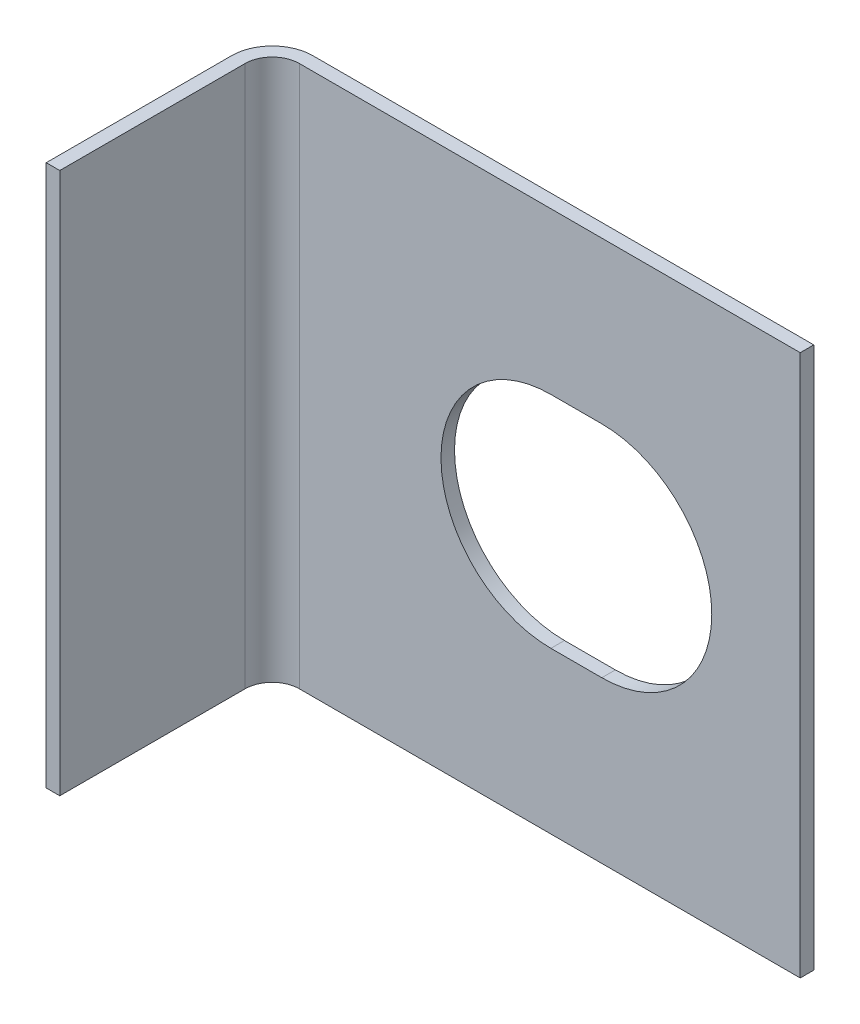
ISO-10303-21;
HEADER;
FILE_DESCRIPTION(('STEP AP214'),'2;1');
FILE_NAME('part.step','',(''),(''),'','','');
FILE_SCHEMA(('AUTOMOTIVE_DESIGN { 1 0 10303 214 1 1 1 1 }'));
ENDSEC;
DATA;
#1=APPLICATION_CONTEXT('core data for automotive mechanical design processes');
#2=APPLICATION_PROTOCOL_DEFINITION('international standard','automotive_design',2000,#1);
#3=PRODUCT_CONTEXT('',#1,'mechanical');
#4=PRODUCT('Part','Part','',(#3));
#5=PRODUCT_RELATED_PRODUCT_CATEGORY('part','',(#4));
#6=PRODUCT_DEFINITION_FORMATION('','',#4);
#7=PRODUCT_DEFINITION_CONTEXT('part definition',#1,'design');
#8=PRODUCT_DEFINITION('design','',#6,#7);
#9=PRODUCT_DEFINITION_SHAPE('','',#8);
#10=(LENGTH_UNIT() NAMED_UNIT(*) SI_UNIT(.MILLI.,.METRE.));
#11=(NAMED_UNIT(*) PLANE_ANGLE_UNIT() SI_UNIT($,.RADIAN.));
#12=(NAMED_UNIT(*) SI_UNIT($,.STERADIAN.) SOLID_ANGLE_UNIT());
#13=UNCERTAINTY_MEASURE_WITH_UNIT(LENGTH_MEASURE(1.E-05),#10,'distance_accuracy_value','');
#14=(GEOMETRIC_REPRESENTATION_CONTEXT(3) GLOBAL_UNCERTAINTY_ASSIGNED_CONTEXT((#13)) GLOBAL_UNIT_ASSIGNED_CONTEXT((#10,
#11,#12)) REPRESENTATION_CONTEXT('',''));
#15=CARTESIAN_POINT('',(0.,0.,0.));
#16=DIRECTION('',(0.,0.,1.));
#17=DIRECTION('',(1.,0.,0.));
#18=AXIS2_PLACEMENT_3D('',#15,#16,#17);
#19=CARTESIAN_POINT('',(-12.995,12.7,1.905));
#20=DIRECTION('',(0.,-1.,0.));
#21=DIRECTION('',(0.,0.,-1.));
#22=AXIS2_PLACEMENT_3D('',#19,#20,#21);
#23=CYLINDRICAL_SURFACE('',#22,1.905);
#24=CARTESIAN_POINT('',(-12.995,-12.7,1.905));
#25=DIRECTION('',(0.,1.,0.));
#26=DIRECTION('',(0.,0.,-1.));
#27=AXIS2_PLACEMENT_3D('',#24,#25,#26);
#28=CIRCLE('',#27,1.905);
#29=CARTESIAN_POINT('',(-12.995,-12.7,0.));
#30=VERTEX_POINT('',#29);
#31=CARTESIAN_POINT('',(-14.9,-12.7,1.905));
#32=VERTEX_POINT('',#31);
#33=EDGE_CURVE('E135',#30,#32,#28,.T.);
#34=ORIENTED_EDGE('',*,*,#33,.T.);
#35=DIRECTION('',(0.,-1.,0.));
#36=VECTOR('',#35,1.);
#37=CARTESIAN_POINT('',(-14.9,12.7,1.905));
#38=LINE('',#37,#36);
#39=CARTESIAN_POINT('',(-14.9,12.7,1.905));
#40=VERTEX_POINT('',#39);
#41=EDGE_CURVE('E9',#40,#32,#38,.T.);
#42=ORIENTED_EDGE('',*,*,#41,.F.);
#43=CARTESIAN_POINT('',(-12.995,12.7,1.905));
#44=DIRECTION('',(0.,1.,0.));
#45=DIRECTION('',(0.,0.,-1.));
#46=AXIS2_PLACEMENT_3D('',#43,#44,#45);
#47=CIRCLE('',#46,1.905);
#48=CARTESIAN_POINT('',(-12.995,12.7,0.));
#49=VERTEX_POINT('',#48);
#50=EDGE_CURVE('E139',#49,#40,#47,.T.);
#51=ORIENTED_EDGE('',*,*,#50,.F.);
#52=DIRECTION('',(0.,-1.,0.));
#53=VECTOR('',#52,1.);
#54=CARTESIAN_POINT('',(-12.995,12.7,0.));
#55=LINE('',#54,#53);
#56=EDGE_CURVE('E157',#49,#30,#55,.T.);
#57=ORIENTED_EDGE('',*,*,#56,.T.);
#58=EDGE_LOOP('',(#34,#42,#51,#57));
#59=FACE_BOUND('',#58,.T.);
#60=ADVANCED_FACE('F14',(#59),#23,.T.);
#61=CARTESIAN_POINT('',(-14.9,12.7,1.905));
#62=DIRECTION('',(1.,0.,0.));
#63=DIRECTION('',(0.,0.,-1.));
#64=AXIS2_PLACEMENT_3D('',#61,#62,#63);
#65=PLANE('',#64);
#66=DIRECTION('',(0.,0.,1.));
#67=VECTOR('',#66,1.);
#68=CARTESIAN_POINT('',(-14.9,-12.7,1.905));
#69=LINE('',#68,#67);
#70=CARTESIAN_POINT('',(-14.9,-12.7,10.6));
#71=VERTEX_POINT('',#70);
#72=EDGE_CURVE('E160',#32,#71,#69,.T.);
#73=ORIENTED_EDGE('',*,*,#72,.T.);
#74=DIRECTION('',(0.,-1.,0.));
#75=VECTOR('',#74,1.);
#76=CARTESIAN_POINT('',(-14.9,12.7,10.6));
#77=LINE('',#76,#75);
#78=CARTESIAN_POINT('',(-14.9,12.7,10.6));
#79=VERTEX_POINT('',#78);
#80=EDGE_CURVE('E21',#79,#71,#77,.T.);
#81=ORIENTED_EDGE('',*,*,#80,.F.);
#82=DIRECTION('',(0.,0.,1.));
#83=VECTOR('',#82,1.);
#84=CARTESIAN_POINT('',(-14.9,12.7,1.905));
#85=LINE('',#84,#83);
#86=EDGE_CURVE('E142',#40,#79,#85,.T.);
#87=ORIENTED_EDGE('',*,*,#86,.F.);
#88=ORIENTED_EDGE('',*,*,#41,.T.);
#89=EDGE_LOOP('',(#73,#81,#87,#88));
#90=FACE_BOUND('',#89,.T.);
#91=ADVANCED_FACE('F217',(#90),#65,.F.);
#92=CARTESIAN_POINT('',(-14.9,12.7,10.6));
#93=DIRECTION('',(0.,0.,-1.));
#94=DIRECTION('',(-1.,0.,0.));
#95=AXIS2_PLACEMENT_3D('',#92,#93,#94);
#96=PLANE('',#95);
#97=DIRECTION('',(1.,0.,0.));
#98=VECTOR('',#97,1.);
#99=CARTESIAN_POINT('',(-14.9,-12.7,10.6));
#100=LINE('',#99,#98);
#101=CARTESIAN_POINT('',(-14.265,-12.7,10.6));
#102=VERTEX_POINT('',#101);
#103=EDGE_CURVE('E162',#71,#102,#100,.T.);
#104=ORIENTED_EDGE('',*,*,#103,.T.);
#105=DIRECTION('',(0.,-1.,0.));
#106=VECTOR('',#105,1.);
#107=CARTESIAN_POINT('',(-14.265,12.7,10.6));
#108=LINE('',#107,#106);
#109=CARTESIAN_POINT('',(-14.265,12.7,10.6));
#110=VERTEX_POINT('',#109);
#111=EDGE_CURVE('E187',#110,#102,#108,.T.);
#112=ORIENTED_EDGE('',*,*,#111,.F.);
#113=DIRECTION('',(1.,0.,0.));
#114=VECTOR('',#113,1.);
#115=CARTESIAN_POINT('',(-14.9,12.7,10.6));
#116=LINE('',#115,#114);
#117=EDGE_CURVE('E145',#79,#110,#116,.T.);
#118=ORIENTED_EDGE('',*,*,#117,.F.);
#119=ORIENTED_EDGE('',*,*,#80,.T.);
#120=EDGE_LOOP('',(#104,#112,#118,#119));
#121=FACE_BOUND('',#120,.T.);
#122=ADVANCED_FACE('F194',(#121),#96,.F.);
#123=CARTESIAN_POINT('',(-14.265,12.7,1.905));
#124=DIRECTION('',(-1.,0.,0.));
#125=DIRECTION('',(0.,0.,1.));
#126=AXIS2_PLACEMENT_3D('',#123,#124,#125);
#127=PLANE('',#126);
#128=DIRECTION('',(0.,0.,-1.));
#129=VECTOR('',#128,1.);
#130=CARTESIAN_POINT('',(-14.265,-12.7,1.905));
#131=LINE('',#130,#129);
#132=CARTESIAN_POINT('',(-14.265,-12.7,1.905));
#133=VERTEX_POINT('',#132);
#134=EDGE_CURVE('E164',#102,#133,#131,.T.);
#135=ORIENTED_EDGE('',*,*,#134,.T.);
#136=DIRECTION('',(0.,-1.,0.));
#137=VECTOR('',#136,1.);
#138=CARTESIAN_POINT('',(-14.265,12.7,1.905));
#139=LINE('',#138,#137);
#140=CARTESIAN_POINT('',(-14.265,12.7,1.905));
#141=VERTEX_POINT('',#140);
#142=EDGE_CURVE('E184',#141,#133,#139,.T.);
#143=ORIENTED_EDGE('',*,*,#142,.F.);
#144=DIRECTION('',(0.,0.,-1.));
#145=VECTOR('',#144,1.);
#146=CARTESIAN_POINT('',(-14.265,12.7,1.905));
#147=LINE('',#146,#145);
#148=EDGE_CURVE('E147',#110,#141,#147,.T.);
#149=ORIENTED_EDGE('',*,*,#148,.F.);
#150=ORIENTED_EDGE('',*,*,#111,.T.);
#151=EDGE_LOOP('',(#135,#143,#149,#150));
#152=FACE_BOUND('',#151,.T.);
#153=ADVANCED_FACE('F205',(#152),#127,.F.);
#154=CARTESIAN_POINT('',(-12.995,12.7,1.905));
#155=DIRECTION('',(0.,-1.,0.));
#156=DIRECTION('',(0.,0.,-1.));
#157=AXIS2_PLACEMENT_3D('',#154,#155,#156);
#158=CYLINDRICAL_SURFACE('',#157,1.27);
#159=CARTESIAN_POINT('',(-12.995,-12.7,1.905));
#160=DIRECTION('',(0.,-1.,0.));
#161=DIRECTION('',(0.,0.,1.));
#162=AXIS2_PLACEMENT_3D('',#159,#160,#161);
#163=CIRCLE('',#162,1.27);
#164=CARTESIAN_POINT('',(-12.995,-12.7,0.635));
#165=VERTEX_POINT('',#164);
#166=EDGE_CURVE('E166',#133,#165,#163,.T.);
#167=ORIENTED_EDGE('',*,*,#166,.T.);
#168=DIRECTION('',(0.,-1.,0.));
#169=VECTOR('',#168,1.);
#170=CARTESIAN_POINT('',(-12.995,12.7,0.635));
#171=LINE('',#170,#169);
#172=CARTESIAN_POINT('',(-12.995,12.7,0.635));
#173=VERTEX_POINT('',#172);
#174=EDGE_CURVE('E181',#173,#165,#171,.T.);
#175=ORIENTED_EDGE('',*,*,#174,.F.);
#176=CARTESIAN_POINT('',(-12.995,12.7,1.905));
#177=DIRECTION('',(0.,-1.,0.));
#178=DIRECTION('',(0.,0.,1.));
#179=AXIS2_PLACEMENT_3D('',#176,#177,#178);
#180=CIRCLE('',#179,1.27);
#181=EDGE_CURVE('E149',#141,#173,#180,.T.);
#182=ORIENTED_EDGE('',*,*,#181,.F.);
#183=ORIENTED_EDGE('',*,*,#142,.T.);
#184=EDGE_LOOP('',(#167,#175,#182,#183));
#185=FACE_BOUND('',#184,.T.);
#186=ADVANCED_FACE('F209',(#185),#158,.F.);
#187=CARTESIAN_POINT('',(10.5,12.7,0.635));
#188=DIRECTION('',(0.,0.,-1.));
#189=DIRECTION('',(-1.,0.,0.));
#190=AXIS2_PLACEMENT_3D('',#187,#188,#189);
#191=PLANE('',#190);
#192=DIRECTION('',(-1.,0.,0.));
#193=VECTOR('',#192,1.);
#194=CARTESIAN_POINT('',(-1.194,-5.156,0.635));
#195=LINE('',#194,#193);
#196=CARTESIAN_POINT('',(1.194,-5.156,0.635));
#197=VERTEX_POINT('',#196);
#198=CARTESIAN_POINT('',(-1.194,-5.156,0.635));
#199=VERTEX_POINT('',#198);
#200=EDGE_CURVE('E110',#197,#199,#195,.T.);
#201=ORIENTED_EDGE('',*,*,#200,.T.);
#202=CARTESIAN_POINT('',(-1.194,0.,0.635));
#203=DIRECTION('',(0.,0.,-1.));
#204=DIRECTION('',(-1.,0.,0.));
#205=AXIS2_PLACEMENT_3D('',#202,#203,#204);
#206=CIRCLE('',#205,5.156);
#207=CARTESIAN_POINT('',(-1.194,5.156,0.635));
#208=VERTEX_POINT('',#207);
#209=EDGE_CURVE('E104',#199,#208,#206,.T.);
#210=ORIENTED_EDGE('',*,*,#209,.T.);
#211=DIRECTION('',(1.,0.,0.));
#212=VECTOR('',#211,1.);
#213=CARTESIAN_POINT('',(-1.194,5.156,0.635));
#214=LINE('',#213,#212);
#215=CARTESIAN_POINT('',(1.194,5.156,0.635));
#216=VERTEX_POINT('',#215);
#217=EDGE_CURVE('E113',#208,#216,#214,.T.);
#218=ORIENTED_EDGE('',*,*,#217,.T.);
#219=CARTESIAN_POINT('',(1.194,0.,0.635));
#220=DIRECTION('',(0.,0.,-1.));
#221=DIRECTION('',(-1.,0.,0.));
#222=AXIS2_PLACEMENT_3D('',#219,#220,#221);
#223=CIRCLE('',#222,5.156);
#224=EDGE_CURVE('E28',#216,#197,#223,.T.);
#225=ORIENTED_EDGE('',*,*,#224,.T.);
#226=EDGE_LOOP('',(#201,#210,#218,#225));
#227=FACE_BOUND('',#226,.T.);
#228=DIRECTION('',(1.,0.,0.));
#229=VECTOR('',#228,1.);
#230=CARTESIAN_POINT('',(10.5,-12.7,0.635));
#231=LINE('',#230,#229);
#232=CARTESIAN_POINT('',(10.5,-12.7,0.635));
#233=VERTEX_POINT('',#232);
#234=EDGE_CURVE('E168',#165,#233,#231,.T.);
#235=ORIENTED_EDGE('',*,*,#234,.T.);
#236=DIRECTION('',(0.,-1.,0.));
#237=VECTOR('',#236,1.);
#238=CARTESIAN_POINT('',(10.5,12.7,0.635));
#239=LINE('',#238,#237);
#240=CARTESIAN_POINT('',(10.5,12.7,0.635));
#241=VERTEX_POINT('',#240);
#242=EDGE_CURVE('E178',#241,#233,#239,.T.);
#243=ORIENTED_EDGE('',*,*,#242,.F.);
#244=DIRECTION('',(1.,0.,0.));
#245=VECTOR('',#244,1.);
#246=CARTESIAN_POINT('',(10.5,12.7,0.635));
#247=LINE('',#246,#245);
#248=EDGE_CURVE('E151',#173,#241,#247,.T.);
#249=ORIENTED_EDGE('',*,*,#248,.F.);
#250=ORIENTED_EDGE('',*,*,#174,.T.);
#251=EDGE_LOOP('',(#235,#243,#249,#250));
#252=FACE_BOUND('',#251,.T.);
#253=ADVANCED_FACE('F117',(#227,#252),#191,.F.);
#254=CARTESIAN_POINT('',(10.5,12.7,0.635));
#255=DIRECTION('',(-1.,0.,0.));
#256=DIRECTION('',(0.,0.,1.));
#257=AXIS2_PLACEMENT_3D('',#254,#255,#256);
#258=PLANE('',#257);
#259=DIRECTION('',(0.,0.,-1.));
#260=VECTOR('',#259,1.);
#261=CARTESIAN_POINT('',(10.5,-12.7,0.635));
#262=LINE('',#261,#260);
#263=CARTESIAN_POINT('',(10.5,-12.7,0.));
#264=VERTEX_POINT('',#263);
#265=EDGE_CURVE('E170',#233,#264,#262,.T.);
#266=ORIENTED_EDGE('',*,*,#265,.T.);
#267=DIRECTION('',(0.,-1.,0.));
#268=VECTOR('',#267,1.);
#269=CARTESIAN_POINT('',(10.5,12.7,0.));
#270=LINE('',#269,#268);
#271=CARTESIAN_POINT('',(10.5,12.7,0.));
#272=VERTEX_POINT('',#271);
#273=EDGE_CURVE('E175',#272,#264,#270,.T.);
#274=ORIENTED_EDGE('',*,*,#273,.F.);
#275=DIRECTION('',(0.,0.,-1.));
#276=VECTOR('',#275,1.);
#277=CARTESIAN_POINT('',(10.5,12.7,0.635));
#278=LINE('',#277,#276);
#279=EDGE_CURVE('E153',#241,#272,#278,.T.);
#280=ORIENTED_EDGE('',*,*,#279,.F.);
#281=ORIENTED_EDGE('',*,*,#242,.T.);
#282=EDGE_LOOP('',(#266,#274,#280,#281));
#283=FACE_BOUND('',#282,.T.);
#284=ADVANCED_FACE('F228',(#283),#258,.F.);
#285=CARTESIAN_POINT('',(10.5,12.7,0.));
#286=DIRECTION('',(0.,0.,1.));
#287=DIRECTION('',(1.,0.,0.));
#288=AXIS2_PLACEMENT_3D('',#285,#286,#287);
#289=PLANE('',#288);
#290=DIRECTION('',(1.,0.,0.));
#291=VECTOR('',#290,1.);
#292=CARTESIAN_POINT('',(-1.194,5.156,0.));
#293=LINE('',#292,#291);
#294=CARTESIAN_POINT('',(-1.194,5.156,0.));
#295=VERTEX_POINT('',#294);
#296=CARTESIAN_POINT('',(1.194,5.156,0.));
#297=VERTEX_POINT('',#296);
#298=EDGE_CURVE('E129',#295,#297,#293,.T.);
#299=ORIENTED_EDGE('',*,*,#298,.F.);
#300=CARTESIAN_POINT('',(-1.194,0.,0.));
#301=DIRECTION('',(0.,0.,-1.));
#302=DIRECTION('',(-1.,0.,0.));
#303=AXIS2_PLACEMENT_3D('',#300,#301,#302);
#304=CIRCLE('',#303,5.156);
#305=CARTESIAN_POINT('',(-1.194,-5.156,0.));
#306=VERTEX_POINT('',#305);
#307=EDGE_CURVE('E36',#306,#295,#304,.T.);
#308=ORIENTED_EDGE('',*,*,#307,.F.);
#309=DIRECTION('',(-1.,0.,0.));
#310=VECTOR('',#309,1.);
#311=CARTESIAN_POINT('',(-1.194,-5.156,0.));
#312=LINE('',#311,#310);
#313=CARTESIAN_POINT('',(1.194,-5.156,0.));
#314=VERTEX_POINT('',#313);
#315=EDGE_CURVE('E120',#314,#306,#312,.T.);
#316=ORIENTED_EDGE('',*,*,#315,.F.);
#317=CARTESIAN_POINT('',(1.194,0.,0.));
#318=DIRECTION('',(0.,0.,-1.));
#319=DIRECTION('',(-1.,0.,0.));
#320=AXIS2_PLACEMENT_3D('',#317,#318,#319);
#321=CIRCLE('',#320,5.156);
#322=EDGE_CURVE('E123',#297,#314,#321,.T.);
#323=ORIENTED_EDGE('',*,*,#322,.F.);
#324=EDGE_LOOP('',(#299,#308,#316,#323));
#325=FACE_BOUND('',#324,.T.);
#326=DIRECTION('',(-1.,0.,0.));
#327=VECTOR('',#326,1.);
#328=CARTESIAN_POINT('',(10.5,-12.7,0.));
#329=LINE('',#328,#327);
#330=EDGE_CURVE('E143',#264,#30,#329,.T.);
#331=ORIENTED_EDGE('',*,*,#330,.T.);
#332=ORIENTED_EDGE('',*,*,#56,.F.);
#333=DIRECTION('',(-1.,0.,0.));
#334=VECTOR('',#333,1.);
#335=CARTESIAN_POINT('',(10.5,12.7,0.));
#336=LINE('',#335,#334);
#337=EDGE_CURVE('E155',#272,#49,#336,.T.);
#338=ORIENTED_EDGE('',*,*,#337,.F.);
#339=ORIENTED_EDGE('',*,*,#273,.T.);
#340=EDGE_LOOP('',(#331,#332,#338,#339));
#341=FACE_BOUND('',#340,.T.);
#342=ADVANCED_FACE('F223',(#325,#341),#289,.F.);
#343=CARTESIAN_POINT('',(-12.995,12.7,1.905));
#344=DIRECTION('',(0.,-1.,0.));
#345=DIRECTION('',(0.,0.,-1.));
#346=AXIS2_PLACEMENT_3D('',#343,#344,#345);
#347=PLANE('',#346);
#348=ORIENTED_EDGE('',*,*,#50,.T.);
#349=ORIENTED_EDGE('',*,*,#86,.T.);
#350=ORIENTED_EDGE('',*,*,#117,.T.);
#351=ORIENTED_EDGE('',*,*,#148,.T.);
#352=ORIENTED_EDGE('',*,*,#181,.T.);
#353=ORIENTED_EDGE('',*,*,#248,.T.);
#354=ORIENTED_EDGE('',*,*,#279,.T.);
#355=ORIENTED_EDGE('',*,*,#337,.T.);
#356=EDGE_LOOP('',(#348,#349,#350,#351,#352,#353,#354,#355));
#357=FACE_BOUND('',#356,.T.);
#358=ADVANCED_FACE('F213',(#357),#347,.F.);
#359=CARTESIAN_POINT('',(-12.995,-12.7,1.905));
#360=DIRECTION('',(0.,-1.,0.));
#361=DIRECTION('',(0.,0.,-1.));
#362=AXIS2_PLACEMENT_3D('',#359,#360,#361);
#363=PLANE('',#362);
#364=ORIENTED_EDGE('',*,*,#33,.F.);
#365=ORIENTED_EDGE('',*,*,#330,.F.);
#366=ORIENTED_EDGE('',*,*,#265,.F.);
#367=ORIENTED_EDGE('',*,*,#234,.F.);
#368=ORIENTED_EDGE('',*,*,#166,.F.);
#369=ORIENTED_EDGE('',*,*,#134,.F.);
#370=ORIENTED_EDGE('',*,*,#103,.F.);
#371=ORIENTED_EDGE('',*,*,#72,.F.);
#372=EDGE_LOOP('',(#364,#365,#366,#367,#368,#369,#370,#371));
#373=FACE_BOUND('',#372,.T.);
#374=ADVANCED_FACE('F200',(#373),#363,.T.);
#375=CARTESIAN_POINT('',(-1.194,0.,0.635));
#376=DIRECTION('',(0.,0.,-1.));
#377=DIRECTION('',(-1.,0.,0.));
#378=AXIS2_PLACEMENT_3D('',#375,#376,#377);
#379=CYLINDRICAL_SURFACE('',#378,5.156);
#380=ORIENTED_EDGE('',*,*,#307,.T.);
#381=DIRECTION('',(0.,0.,-1.));
#382=VECTOR('',#381,1.);
#383=CARTESIAN_POINT('',(-1.194,5.156,0.635));
#384=LINE('',#383,#382);
#385=EDGE_CURVE('E100',#208,#295,#384,.T.);
#386=ORIENTED_EDGE('',*,*,#385,.F.);
#387=ORIENTED_EDGE('',*,*,#209,.F.);
#388=DIRECTION('',(0.,0.,-1.));
#389=VECTOR('',#388,1.);
#390=CARTESIAN_POINT('',(-1.194,-5.156,0.635));
#391=LINE('',#390,#389);
#392=EDGE_CURVE('E133',#199,#306,#391,.T.);
#393=ORIENTED_EDGE('',*,*,#392,.T.);
#394=EDGE_LOOP('',(#380,#386,#387,#393));
#395=FACE_BOUND('',#394,.T.);
#396=ADVANCED_FACE('F102',(#395),#379,.F.);
#397=CARTESIAN_POINT('',(-1.194,-5.156,0.635));
#398=DIRECTION('',(0.,-1.,0.));
#399=DIRECTION('',(0.,0.,-1.));
#400=AXIS2_PLACEMENT_3D('',#397,#398,#399);
#401=PLANE('',#400);
#402=ORIENTED_EDGE('',*,*,#315,.T.);
#403=ORIENTED_EDGE('',*,*,#392,.F.);
#404=ORIENTED_EDGE('',*,*,#200,.F.);
#405=DIRECTION('',(0.,0.,-1.));
#406=VECTOR('',#405,1.);
#407=CARTESIAN_POINT('',(1.194,-5.156,0.635));
#408=LINE('',#407,#406);
#409=EDGE_CURVE('E136',#197,#314,#408,.T.);
#410=ORIENTED_EDGE('',*,*,#409,.T.);
#411=EDGE_LOOP('',(#402,#403,#404,#410));
#412=FACE_BOUND('',#411,.T.);
#413=ADVANCED_FACE('F318',(#412),#401,.F.);
#414=CARTESIAN_POINT('',(1.194,0.,0.635));
#415=DIRECTION('',(0.,0.,-1.));
#416=DIRECTION('',(-1.,0.,0.));
#417=AXIS2_PLACEMENT_3D('',#414,#415,#416);
#418=CYLINDRICAL_SURFACE('',#417,5.156);
#419=ORIENTED_EDGE('',*,*,#322,.T.);
#420=ORIENTED_EDGE('',*,*,#409,.F.);
#421=ORIENTED_EDGE('',*,*,#224,.F.);
#422=DIRECTION('',(0.,0.,-1.));
#423=VECTOR('',#422,1.);
#424=CARTESIAN_POINT('',(1.194,5.156,0.635));
#425=LINE('',#424,#423);
#426=EDGE_CURVE('E109',#216,#297,#425,.T.);
#427=ORIENTED_EDGE('',*,*,#426,.T.);
#428=EDGE_LOOP('',(#419,#420,#421,#427));
#429=FACE_BOUND('',#428,.T.);
#430=ADVANCED_FACE('F326',(#429),#418,.F.);
#431=CARTESIAN_POINT('',(-1.194,5.156,0.635));
#432=DIRECTION('',(0.,1.,0.));
#433=DIRECTION('',(0.,0.,1.));
#434=AXIS2_PLACEMENT_3D('',#431,#432,#433);
#435=PLANE('',#434);
#436=ORIENTED_EDGE('',*,*,#298,.T.);
#437=ORIENTED_EDGE('',*,*,#426,.F.);
#438=ORIENTED_EDGE('',*,*,#217,.F.);
#439=ORIENTED_EDGE('',*,*,#385,.T.);
#440=EDGE_LOOP('',(#436,#437,#438,#439));
#441=FACE_BOUND('',#440,.T.);
#442=ADVANCED_FACE('F114',(#441),#435,.F.);
#443=CLOSED_SHELL('',(#60,#91,#122,#153,#186,#253,#284,#342,#358,#374,#396,#413,#430,#442));
#444=MANIFOLD_SOLID_BREP('B1',#443);
#445=ADVANCED_BREP_SHAPE_REPRESENTATION('',(#18,#444),#14);
#446=SHAPE_DEFINITION_REPRESENTATION(#9,#445);
ENDSEC;
END-ISO-10303-21;
